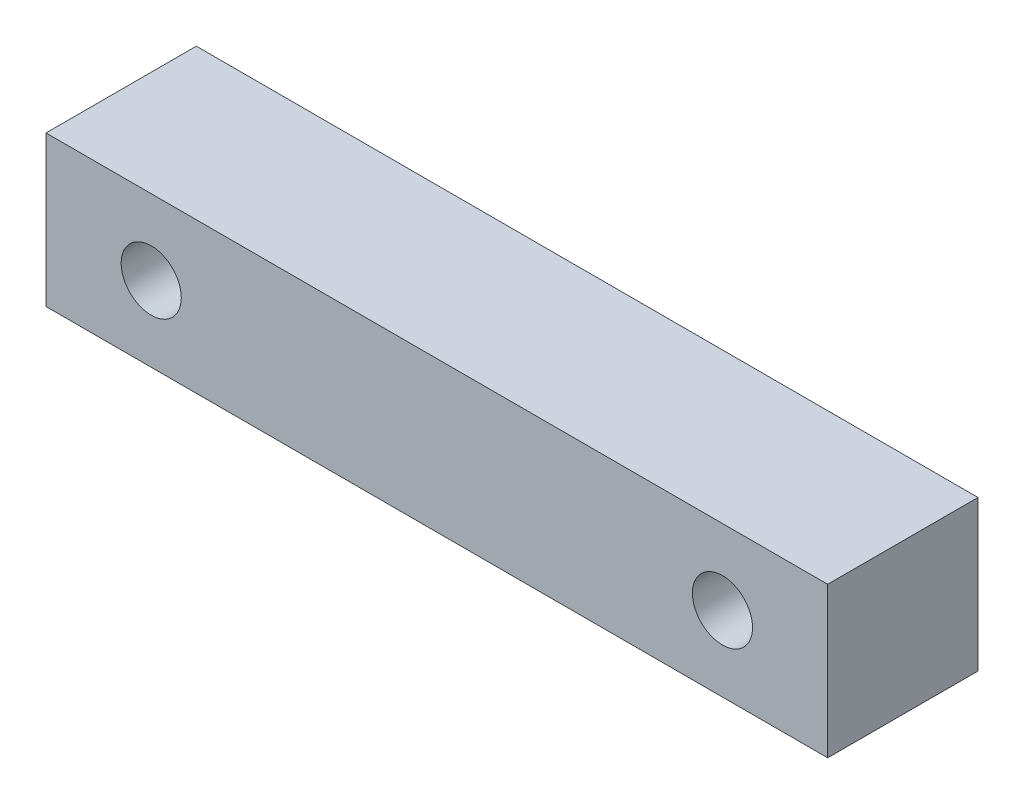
ISO-10303-21;
HEADER;
FILE_DESCRIPTION(('STEP AP214'),'2;1');
FILE_NAME('part.step','',(''),(''),'','','');
FILE_SCHEMA(('AUTOMOTIVE_DESIGN { 1 0 10303 214 1 1 1 1 }'));
ENDSEC;
DATA;
#1=APPLICATION_CONTEXT('core data for automotive mechanical design processes');
#2=APPLICATION_PROTOCOL_DEFINITION('international standard','automotive_design',2000,#1);
#3=PRODUCT_CONTEXT('',#1,'mechanical');
#4=PRODUCT('Part','Part','',(#3));
#5=PRODUCT_RELATED_PRODUCT_CATEGORY('part','',(#4));
#6=PRODUCT_DEFINITION_FORMATION('','',#4);
#7=PRODUCT_DEFINITION_CONTEXT('part definition',#1,'design');
#8=PRODUCT_DEFINITION('design','',#6,#7);
#9=PRODUCT_DEFINITION_SHAPE('','',#8);
#10=(LENGTH_UNIT() NAMED_UNIT(*) SI_UNIT(.MILLI.,.METRE.));
#11=(NAMED_UNIT(*) PLANE_ANGLE_UNIT() SI_UNIT($,.RADIAN.));
#12=(NAMED_UNIT(*) SI_UNIT($,.STERADIAN.) SOLID_ANGLE_UNIT());
#13=UNCERTAINTY_MEASURE_WITH_UNIT(LENGTH_MEASURE(1.E-05),#10,'distance_accuracy_value','');
#14=(GEOMETRIC_REPRESENTATION_CONTEXT(3) GLOBAL_UNCERTAINTY_ASSIGNED_CONTEXT((#13)) GLOBAL_UNIT_ASSIGNED_CONTEXT((#10,
#11,#12)) REPRESENTATION_CONTEXT('',''));
#15=CARTESIAN_POINT('',(0.,0.,0.));
#16=DIRECTION('',(0.,0.,1.));
#17=DIRECTION('',(1.,0.,0.));
#18=AXIS2_PLACEMENT_3D('',#15,#16,#17);
#19=CARTESIAN_POINT('',(-13.,2.5,5.));
#20=DIRECTION('',(1.,0.,0.));
#21=DIRECTION('',(0.,0.,-1.));
#22=AXIS2_PLACEMENT_3D('',#19,#20,#21);
#23=PLANE('',#22);
#24=DIRECTION('',(0.,-1.,0.));
#25=VECTOR('',#24,1.);
#26=CARTESIAN_POINT('',(-13.,2.5,0.));
#27=LINE('',#26,#25);
#28=CARTESIAN_POINT('',(-13.,2.5,0.));
#29=VERTEX_POINT('',#28);
#30=CARTESIAN_POINT('',(-13.,-2.5,0.));
#31=VERTEX_POINT('',#30);
#32=EDGE_CURVE('E98',#29,#31,#27,.T.);
#33=ORIENTED_EDGE('',*,*,#32,.T.);
#34=DIRECTION('',(0.,0.,-1.));
#35=VECTOR('',#34,1.);
#36=CARTESIAN_POINT('',(-13.,-2.5,5.));
#37=LINE('',#36,#35);
#38=CARTESIAN_POINT('',(-13.,-2.5,5.));
#39=VERTEX_POINT('',#38);
#40=EDGE_CURVE('E11',#39,#31,#37,.T.);
#41=ORIENTED_EDGE('',*,*,#40,.F.);
#42=DIRECTION('',(0.,-1.,0.));
#43=VECTOR('',#42,1.);
#44=CARTESIAN_POINT('',(-13.,2.5,5.));
#45=LINE('',#44,#43);
#46=CARTESIAN_POINT('',(-13.,2.5,5.));
#47=VERTEX_POINT('',#46);
#48=EDGE_CURVE('E86',#47,#39,#45,.T.);
#49=ORIENTED_EDGE('',*,*,#48,.F.);
#50=DIRECTION('',(0.,0.,-1.));
#51=VECTOR('',#50,1.);
#52=CARTESIAN_POINT('',(-13.,2.5,5.));
#53=LINE('',#52,#51);
#54=EDGE_CURVE('E94',#47,#29,#53,.T.);
#55=ORIENTED_EDGE('',*,*,#54,.T.);
#56=EDGE_LOOP('',(#33,#41,#49,#55));
#57=FACE_BOUND('',#56,.T.);
#58=ADVANCED_FACE('F35',(#57),#23,.F.);
#59=CARTESIAN_POINT('',(-13.,-2.5,5.));
#60=DIRECTION('',(0.,1.,0.));
#61=DIRECTION('',(0.,0.,1.));
#62=AXIS2_PLACEMENT_3D('',#59,#60,#61);
#63=PLANE('',#62);
#64=DIRECTION('',(1.,0.,0.));
#65=VECTOR('',#64,1.);
#66=CARTESIAN_POINT('',(-13.,-2.5,0.));
#67=LINE('',#66,#65);
#68=CARTESIAN_POINT('',(13.,-2.5,0.));
#69=VERTEX_POINT('',#68);
#70=EDGE_CURVE('E90',#31,#69,#67,.T.);
#71=ORIENTED_EDGE('',*,*,#70,.T.);
#72=DIRECTION('',(0.,0.,-1.));
#73=VECTOR('',#72,1.);
#74=CARTESIAN_POINT('',(13.,-2.5,5.));
#75=LINE('',#74,#73);
#76=CARTESIAN_POINT('',(13.,-2.5,5.));
#77=VERTEX_POINT('',#76);
#78=EDGE_CURVE('E43',#77,#69,#75,.T.);
#79=ORIENTED_EDGE('',*,*,#78,.F.);
#80=DIRECTION('',(1.,0.,0.));
#81=VECTOR('',#80,1.);
#82=CARTESIAN_POINT('',(-13.,-2.5,5.));
#83=LINE('',#82,#81);
#84=EDGE_CURVE('E81',#39,#77,#83,.T.);
#85=ORIENTED_EDGE('',*,*,#84,.F.);
#86=ORIENTED_EDGE('',*,*,#40,.T.);
#87=EDGE_LOOP('',(#71,#79,#85,#86));
#88=FACE_BOUND('',#87,.T.);
#89=ADVANCED_FACE('F89',(#88),#63,.F.);
#90=CARTESIAN_POINT('',(13.,2.5,5.));
#91=DIRECTION('',(-1.,0.,0.));
#92=DIRECTION('',(0.,0.,1.));
#93=AXIS2_PLACEMENT_3D('',#90,#91,#92);
#94=PLANE('',#93);
#95=DIRECTION('',(0.,1.,0.));
#96=VECTOR('',#95,1.);
#97=CARTESIAN_POINT('',(13.,2.5,0.));
#98=LINE('',#97,#96);
#99=CARTESIAN_POINT('',(13.,2.5,0.));
#100=VERTEX_POINT('',#99);
#101=EDGE_CURVE('E68',#69,#100,#98,.T.);
#102=ORIENTED_EDGE('',*,*,#101,.T.);
#103=DIRECTION('',(0.,0.,-1.));
#104=VECTOR('',#103,1.);
#105=CARTESIAN_POINT('',(13.,2.5,5.));
#106=LINE('',#105,#104);
#107=CARTESIAN_POINT('',(13.,2.5,5.));
#108=VERTEX_POINT('',#107);
#109=EDGE_CURVE('E91',#108,#100,#106,.T.);
#110=ORIENTED_EDGE('',*,*,#109,.F.);
#111=DIRECTION('',(0.,1.,0.));
#112=VECTOR('',#111,1.);
#113=CARTESIAN_POINT('',(13.,2.5,5.));
#114=LINE('',#113,#112);
#115=EDGE_CURVE('E84',#77,#108,#114,.T.);
#116=ORIENTED_EDGE('',*,*,#115,.F.);
#117=ORIENTED_EDGE('',*,*,#78,.T.);
#118=EDGE_LOOP('',(#102,#110,#116,#117));
#119=FACE_BOUND('',#118,.T.);
#120=ADVANCED_FACE('F92',(#119),#94,.F.);
#121=CARTESIAN_POINT('',(-13.,2.5,5.));
#122=DIRECTION('',(0.,-1.,0.));
#123=DIRECTION('',(0.,0.,-1.));
#124=AXIS2_PLACEMENT_3D('',#121,#122,#123);
#125=PLANE('',#124);
#126=DIRECTION('',(-1.,0.,0.));
#127=VECTOR('',#126,1.);
#128=CARTESIAN_POINT('',(-13.,2.5,0.));
#129=LINE('',#128,#127);
#130=EDGE_CURVE('E74',#100,#29,#129,.T.);
#131=ORIENTED_EDGE('',*,*,#130,.T.);
#132=ORIENTED_EDGE('',*,*,#54,.F.);
#133=DIRECTION('',(-1.,0.,0.));
#134=VECTOR('',#133,1.);
#135=CARTESIAN_POINT('',(-13.,2.5,5.));
#136=LINE('',#135,#134);
#137=EDGE_CURVE('E51',#108,#47,#136,.T.);
#138=ORIENTED_EDGE('',*,*,#137,.F.);
#139=ORIENTED_EDGE('',*,*,#109,.T.);
#140=EDGE_LOOP('',(#131,#132,#138,#139));
#141=FACE_BOUND('',#140,.T.);
#142=ADVANCED_FACE('F106',(#141),#125,.F.);
#143=CARTESIAN_POINT('',(0.,0.,5.));
#144=DIRECTION('',(0.,0.,1.));
#145=DIRECTION('',(1.,0.,0.));
#146=AXIS2_PLACEMENT_3D('',#143,#144,#145);
#147=PLANE('',#146);
#148=CARTESIAN_POINT('',(9.5,0.,5.));
#149=DIRECTION('',(0.,0.,1.));
#150=DIRECTION('',(1.,0.,0.));
#151=AXIS2_PLACEMENT_3D('',#148,#149,#150);
#152=CIRCLE('',#151,1.);
#153=CARTESIAN_POINT('',(10.5,0.,5.));
#154=VERTEX_POINT('',#153);
#155=EDGE_CURVE('E118',#154,#154,#152,.T.);
#156=ORIENTED_EDGE('',*,*,#155,.F.);
#157=EDGE_LOOP('',(#156));
#158=FACE_BOUND('',#157,.T.);
#159=CARTESIAN_POINT('',(-9.5,0.,5.));
#160=DIRECTION('',(0.,0.,1.));
#161=DIRECTION('',(1.,0.,0.));
#162=AXIS2_PLACEMENT_3D('',#159,#160,#161);
#163=CIRCLE('',#162,1.);
#164=CARTESIAN_POINT('',(-8.5,0.,5.));
#165=VERTEX_POINT('',#164);
#166=EDGE_CURVE('E112',#165,#165,#163,.T.);
#167=ORIENTED_EDGE('',*,*,#166,.F.);
#168=EDGE_LOOP('',(#167));
#169=FACE_BOUND('',#168,.T.);
#170=ORIENTED_EDGE('',*,*,#48,.T.);
#171=ORIENTED_EDGE('',*,*,#84,.T.);
#172=ORIENTED_EDGE('',*,*,#115,.T.);
#173=ORIENTED_EDGE('',*,*,#137,.T.);
#174=EDGE_LOOP('',(#170,#171,#172,#173));
#175=FACE_BOUND('',#174,.T.);
#176=ADVANCED_FACE('F82',(#158,#169,#175),#147,.T.);
#177=CARTESIAN_POINT('',(0.,0.,0.));
#178=DIRECTION('',(0.,0.,1.));
#179=DIRECTION('',(1.,0.,0.));
#180=AXIS2_PLACEMENT_3D('',#177,#178,#179);
#181=PLANE('',#180);
#182=CARTESIAN_POINT('',(9.5,0.,0.));
#183=DIRECTION('',(0.,0.,1.));
#184=DIRECTION('',(1.,0.,0.));
#185=AXIS2_PLACEMENT_3D('',#182,#183,#184);
#186=CIRCLE('',#185,1.);
#187=CARTESIAN_POINT('',(10.5,0.,0.));
#188=VERTEX_POINT('',#187);
#189=EDGE_CURVE('E115',#188,#188,#186,.T.);
#190=ORIENTED_EDGE('',*,*,#189,.T.);
#191=EDGE_LOOP('',(#190));
#192=FACE_BOUND('',#191,.T.);
#193=CARTESIAN_POINT('',(-9.5,0.,0.));
#194=DIRECTION('',(0.,0.,1.));
#195=DIRECTION('',(1.,0.,0.));
#196=AXIS2_PLACEMENT_3D('',#193,#194,#195);
#197=CIRCLE('',#196,1.);
#198=CARTESIAN_POINT('',(-8.5,0.,0.));
#199=VERTEX_POINT('',#198);
#200=EDGE_CURVE('E101',#199,#199,#197,.T.);
#201=ORIENTED_EDGE('',*,*,#200,.T.);
#202=EDGE_LOOP('',(#201));
#203=FACE_BOUND('',#202,.T.);
#204=ORIENTED_EDGE('',*,*,#32,.F.);
#205=ORIENTED_EDGE('',*,*,#130,.F.);
#206=ORIENTED_EDGE('',*,*,#101,.F.);
#207=ORIENTED_EDGE('',*,*,#70,.F.);
#208=EDGE_LOOP('',(#204,#205,#206,#207));
#209=FACE_BOUND('',#208,.T.);
#210=ADVANCED_FACE('F109',(#192,#203,#209),#181,.F.);
#211=CARTESIAN_POINT('',(-9.5,0.,0.));
#212=DIRECTION('',(0.,0.,1.));
#213=DIRECTION('',(1.,0.,0.));
#214=AXIS2_PLACEMENT_3D('',#211,#212,#213);
#215=CYLINDRICAL_SURFACE('',#214,1.);
#216=ORIENTED_EDGE('',*,*,#200,.F.);
#217=EDGE_LOOP('',(#216));
#218=FACE_BOUND('',#217,.T.);
#219=ORIENTED_EDGE('',*,*,#166,.T.);
#220=EDGE_LOOP('',(#219));
#221=FACE_BOUND('',#220,.T.);
#222=ADVANCED_FACE('F129',(#218,#221),#215,.F.);
#223=CARTESIAN_POINT('',(9.5,0.,0.));
#224=DIRECTION('',(0.,0.,1.));
#225=DIRECTION('',(1.,0.,0.));
#226=AXIS2_PLACEMENT_3D('',#223,#224,#225);
#227=CYLINDRICAL_SURFACE('',#226,1.);
#228=ORIENTED_EDGE('',*,*,#189,.F.);
#229=EDGE_LOOP('',(#228));
#230=FACE_BOUND('',#229,.T.);
#231=ORIENTED_EDGE('',*,*,#155,.T.);
#232=EDGE_LOOP('',(#231));
#233=FACE_BOUND('',#232,.T.);
#234=ADVANCED_FACE('F126',(#230,#233),#227,.F.);
#235=CLOSED_SHELL('',(#58,#89,#120,#142,#176,#210,#222,#234));
#236=MANIFOLD_SOLID_BREP('B2',#235);
#237=ADVANCED_BREP_SHAPE_REPRESENTATION('',(#18,#236),#14);
#238=SHAPE_DEFINITION_REPRESENTATION(#9,#237);
ENDSEC;
END-ISO-10303-21;
